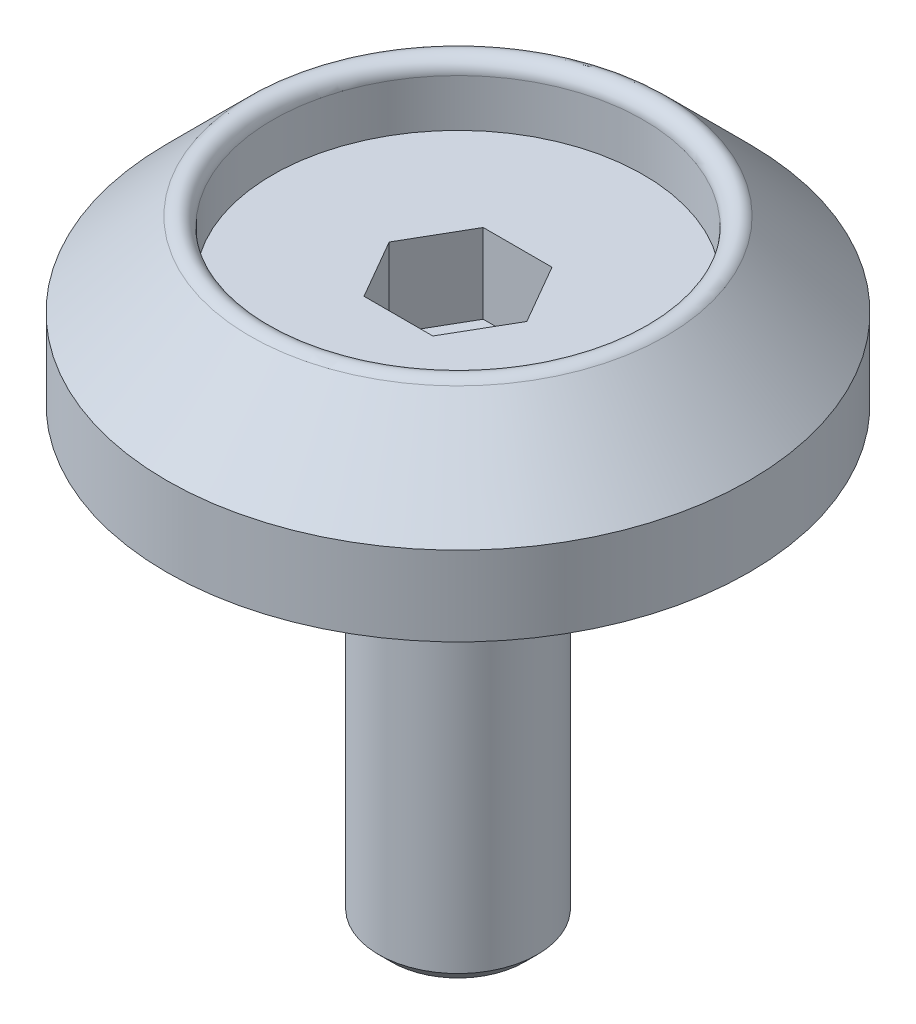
from build123d import *

# Parameters (mm, degrees)
ENL_V_MAT_EXTRU_1_DEPTH = 1.5


with BuildPart() as part:
    # Esquisse1 → Base-R_volution (revolve)
    with BuildSketch(Plane.XY):
        with BuildLine():
            Line((0, 0), (1.25, 0))
            Line((1.25, 0), (1.5, 0.25))
            Line((1.5, 0.25), (1.5, 8.5))
            Line((1.5, 8.5), (5.5, 8.5))
            Line((5.5, 8.5), (5.5, 10))
            Line((5.5, 10), (3.926776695, 11.573223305))
            ThreePointArc((3.926776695, 11.573223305), (3.654329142, 11.627416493), (3.5, 11.396446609))
            Line((3.5, 11.396446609), (3.5, 10.5))
            Line((3.5, 10.5), (0, 10.5))
            Line((0, 10.5), (0, 0))
        make_face()
    revolve(axis=Axis((0, -3.120322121, 0), (0, 1, 0)))

    # Esquisse2 → Enl_v. mat.-Extru.1 (cut)
    with BuildSketch(Plane(origin=(0, 10.5, 0), x_dir=(-1, 0, 0), z_dir=(0, 1, 0))):
        Polygon((-0.649519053, 1.125), (0.649519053, 1.125), (1.299038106, 0), (0.649519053, -1.125), (-0.649519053, -1.125), (-1.299038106, 0), align=None)
    extrude(amount=-ENL_V_MAT_EXTRU_1_DEPTH, mode=Mode.SUBTRACT)


solid = part.part
